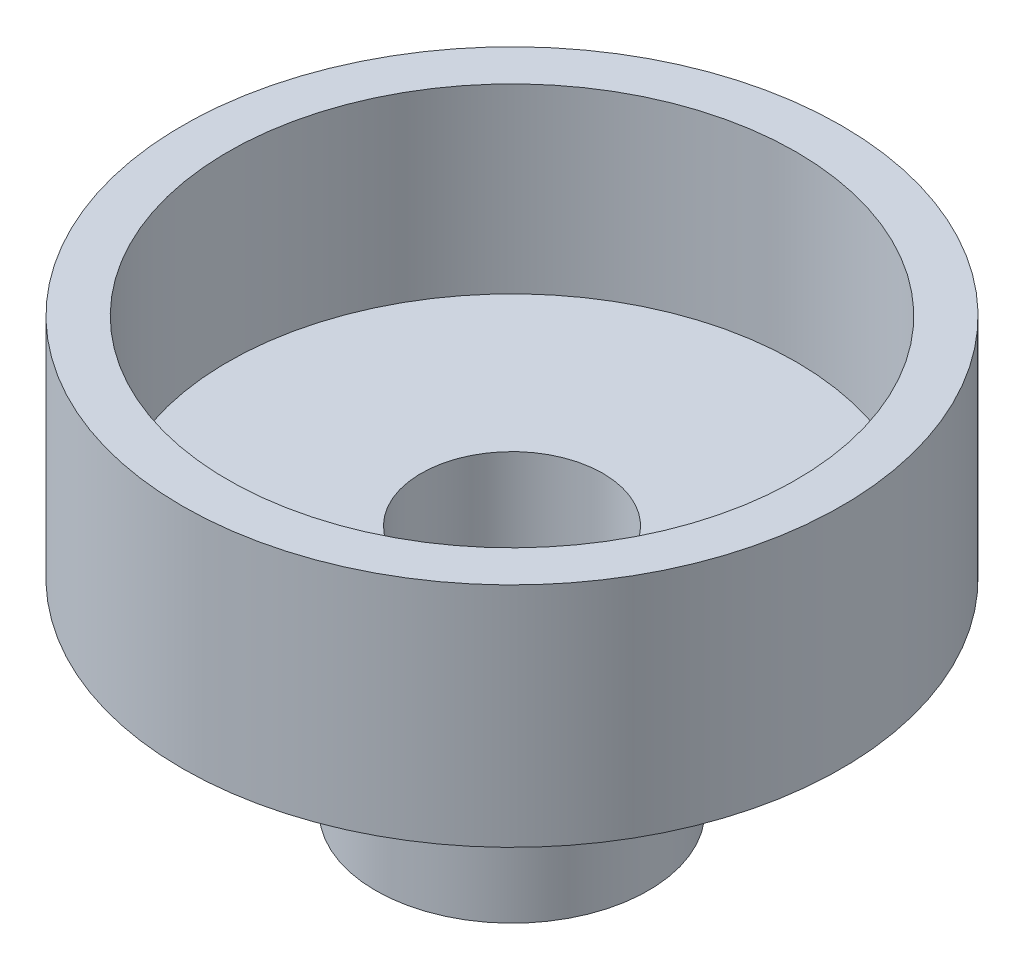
from build123d import *


with BuildPart() as part:
    # Esquisse2 → R_volution1 (revolve)
    with BuildSketch(Plane.XY, mode=Mode.PRIVATE) as r_volution1_sk:
        Polygon((62.5, 75.182682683), (62.5, 35.182682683), (20, 35.182682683), (20, 12.682682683), (21.5, 12.682682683), (21.5, 11.182682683), (20, 11.182682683), (20, -19.317317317), (30, -19.317317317), (30, 25.182682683), (72.5, 25.182682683), (72.5, 75.182682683), align=None)
    revolve(r_volution1_sk.sketch.rotate(Axis((0, -55, 0), (0, 1, 0)), 90), axis=Axis((0, -55, 0), (0, 1, 0)))


solid = part.part
